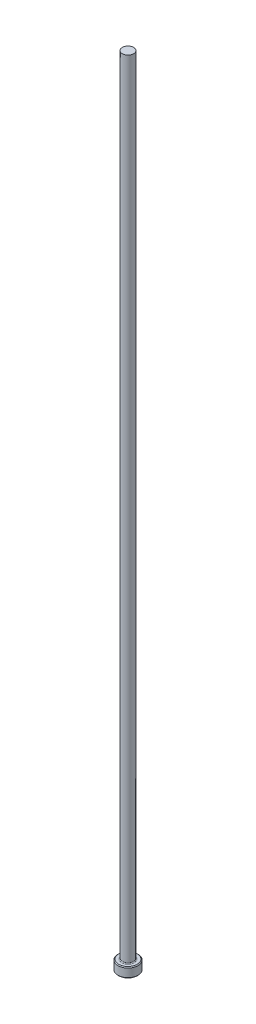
from build123d import *

# Parameters (mm, degrees)
CHAMFER1_SIZE = 0.254
FILLET1_R     = 0.254


with BuildPart() as part:
    # Sketch1 → Revolve1 (revolve)
    with BuildSketch(Plane.XY, mode=Mode.PRIVATE) as revolve1_sk:
        Polygon((0, 0), (-3.175, 0), (-3.175, 3.175), (-1.78562, 3.175), (-1.78562, 254), (0, 254), align=None)
    revolve(revolve1_sk.sketch.rotate(Axis((0, 259.958771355, 0), (0, -1, 0)), 270), axis=Axis((0, 259.958771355, 0), (0, -1, 0)))

    # Chamfer1
    chamfer1_edges = [part.edges().sort_by_distance(p)[0] for p in [
        (0, 3.175, -3.175),
        (0, 0, -3.175),
    ]]
    chamfer(chamfer1_edges, length=CHAMFER1_SIZE)

    # Fillet1
    fillet1_edges = [part.edges().sort_by_distance(p)[0] for p in [
        (0, 3.175, -1.78562),
    ]]
    fillet(fillet1_edges, radius=FILLET1_R)


solid = part.part
